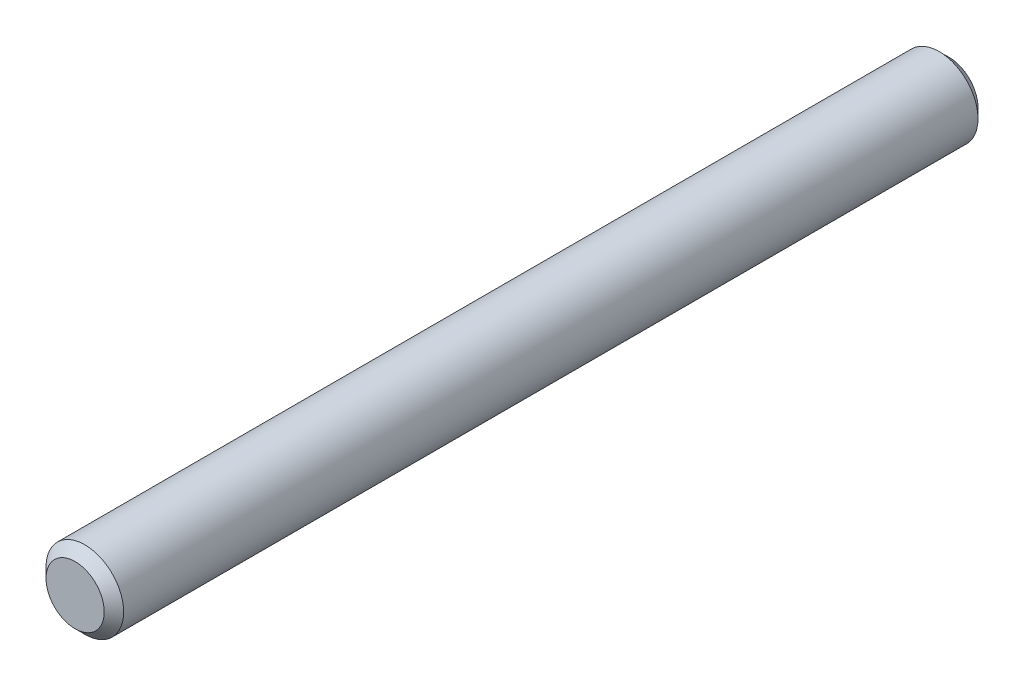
from build123d import *

# Parameters (mm, degrees)
BASE_EXTRUSION_DEPTH      = 20
BASE_EXTRUSION_DEPTH_BACK = 2.5
ESQUISSE1_R               = 1
CHANFREIN1_SIZE           = 0.25


with BuildPart() as part:
    # Esquisse1 → Base-Extrusion (new, two sides: drawn at the far end of the back side and taken through both)
    with BuildSketch(Plane.XY.offset(-BASE_EXTRUSION_DEPTH_BACK)):
        with Locations((16.875, -2.521642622)):
            Circle(ESQUISSE1_R)
    extrude(amount=BASE_EXTRUSION_DEPTH + BASE_EXTRUSION_DEPTH_BACK)

    # Chanfrein1
    chanfrein1_edges = [part.edges().sort_by_distance(p)[0] for p in [
        (15.875, -2.521642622, 20),
        (15.875, -2.521642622, -2.5),
    ]]
    chamfer(chanfrein1_edges, length=CHANFREIN1_SIZE)


solid = part.part
